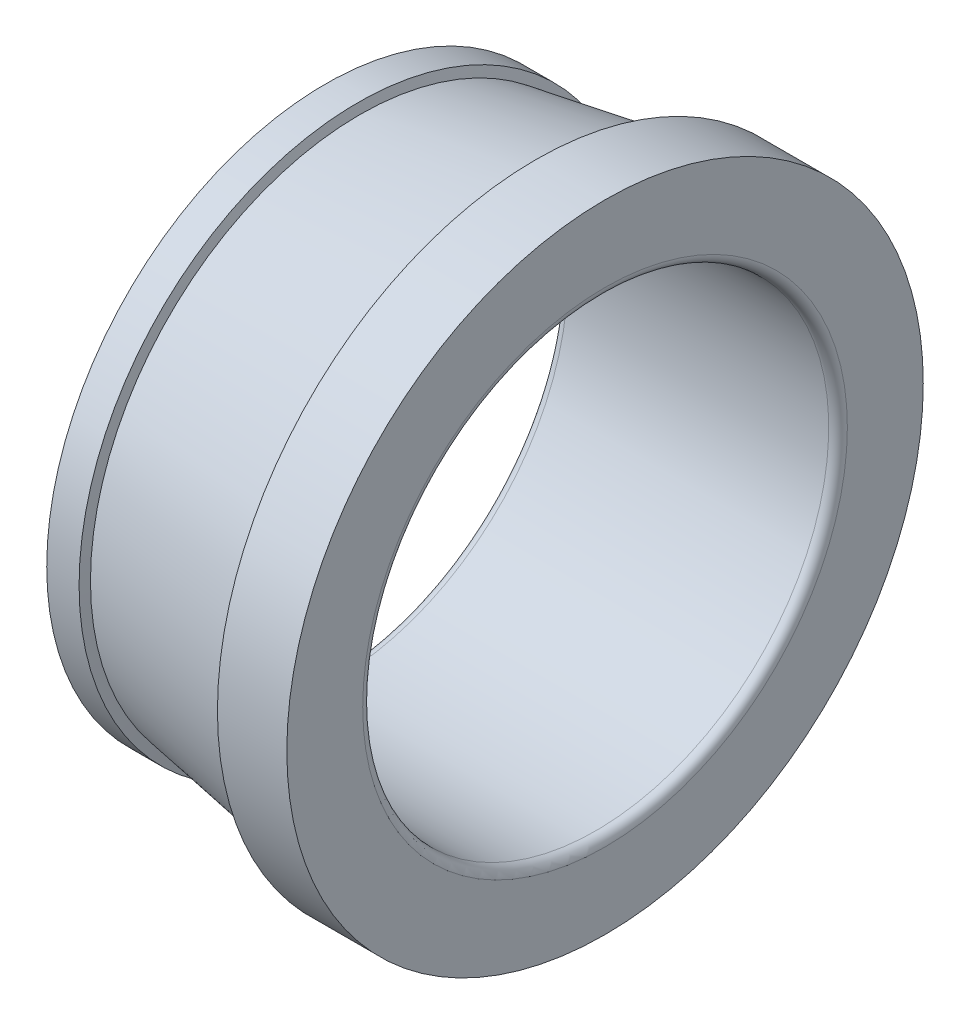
ISO-10303-21;
HEADER;
FILE_DESCRIPTION(('STEP AP214'),'2;1');
FILE_NAME('part.step','',(''),(''),'','','');
FILE_SCHEMA(('AUTOMOTIVE_DESIGN { 1 0 10303 214 1 1 1 1 }'));
ENDSEC;
DATA;
#1=APPLICATION_CONTEXT('core data for automotive mechanical design processes');
#2=APPLICATION_PROTOCOL_DEFINITION('international standard','automotive_design',2000,#1);
#3=PRODUCT_CONTEXT('',#1,'mechanical');
#4=PRODUCT('Part','Part','',(#3));
#5=PRODUCT_RELATED_PRODUCT_CATEGORY('part','',(#4));
#6=PRODUCT_DEFINITION_FORMATION('','',#4);
#7=PRODUCT_DEFINITION_CONTEXT('part definition',#1,'design');
#8=PRODUCT_DEFINITION('design','',#6,#7);
#9=PRODUCT_DEFINITION_SHAPE('','',#8);
#10=(LENGTH_UNIT() NAMED_UNIT(*) SI_UNIT(.MILLI.,.METRE.));
#11=(NAMED_UNIT(*) PLANE_ANGLE_UNIT() SI_UNIT($,.RADIAN.));
#12=(NAMED_UNIT(*) SI_UNIT($,.STERADIAN.) SOLID_ANGLE_UNIT());
#13=UNCERTAINTY_MEASURE_WITH_UNIT(LENGTH_MEASURE(1.E-05),#10,'distance_accuracy_value','');
#14=(GEOMETRIC_REPRESENTATION_CONTEXT(3) GLOBAL_UNCERTAINTY_ASSIGNED_CONTEXT((#13)) GLOBAL_UNIT_ASSIGNED_CONTEXT((#10,
#11,#12)) REPRESENTATION_CONTEXT('',''));
#15=CARTESIAN_POINT('',(0.,0.,0.));
#16=DIRECTION('',(0.,0.,1.));
#17=DIRECTION('',(1.,0.,0.));
#18=AXIS2_PLACEMENT_3D('',#15,#16,#17);
#19=CARTESIAN_POINT('',(0.500000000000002,0.,0.));
#20=DIRECTION('',(-1.,0.,0.));
#21=DIRECTION('',(0.,0.,1.));
#22=AXIS2_PLACEMENT_3D('',#19,#20,#21);
#23=TOROIDAL_SURFACE('',#22,13.,0.499999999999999);
#24=CARTESIAN_POINT('',(0.500000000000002,0.,0.));
#25=DIRECTION('',(-1.,0.,0.));
#26=DIRECTION('',(0.,0.,1.));
#27=AXIS2_PLACEMENT_3D('',#24,#25,#26);
#28=CIRCLE('',#27,12.5);
#29=CARTESIAN_POINT('',(0.500000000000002,0.,12.5));
#30=VERTEX_POINT('',#29);
#31=EDGE_CURVE('E10',#30,#30,#28,.T.);
#32=ORIENTED_EDGE('',*,*,#31,.F.);
#33=EDGE_LOOP('',(#32));
#34=FACE_BOUND('',#33,.T.);
#35=CARTESIAN_POINT('',(0.,0.,0.));
#36=DIRECTION('',(-1.,0.,0.));
#37=DIRECTION('',(0.,0.,1.));
#38=AXIS2_PLACEMENT_3D('',#35,#36,#37);
#39=CIRCLE('',#38,13.);
#40=CARTESIAN_POINT('',(0.,0.,13.));
#41=VERTEX_POINT('',#40);
#42=EDGE_CURVE('E58',#41,#41,#39,.T.);
#43=ORIENTED_EDGE('',*,*,#42,.T.);
#44=EDGE_LOOP('',(#43));
#45=FACE_BOUND('',#44,.T.);
#46=ADVANCED_FACE('F24',(#34,#45),#23,.T.);
#47=CARTESIAN_POINT('',(0.,0.,0.));
#48=DIRECTION('',(-1.,0.,0.));
#49=DIRECTION('',(0.,0.,1.));
#50=AXIS2_PLACEMENT_3D('',#47,#48,#49);
#51=CYLINDRICAL_SURFACE('',#50,12.5);
#52=CARTESIAN_POINT('',(14.5,0.,0.));
#53=DIRECTION('',(-1.,0.,0.));
#54=DIRECTION('',(0.,0.,1.));
#55=AXIS2_PLACEMENT_3D('',#52,#53,#54);
#56=CIRCLE('',#55,12.5);
#57=CARTESIAN_POINT('',(14.5,0.,12.5));
#58=VERTEX_POINT('',#57);
#59=EDGE_CURVE('E30',#58,#58,#56,.T.);
#60=ORIENTED_EDGE('',*,*,#59,.F.);
#61=EDGE_LOOP('',(#60));
#62=FACE_BOUND('',#61,.T.);
#63=ORIENTED_EDGE('',*,*,#31,.T.);
#64=EDGE_LOOP('',(#63));
#65=FACE_BOUND('',#64,.T.);
#66=ADVANCED_FACE('F107',(#62,#65),#51,.F.);
#67=CARTESIAN_POINT('',(14.5,0.,0.));
#68=DIRECTION('',(-1.,0.,0.));
#69=DIRECTION('',(0.,0.,1.));
#70=AXIS2_PLACEMENT_3D('',#67,#68,#69);
#71=TOROIDAL_SURFACE('',#70,13.,0.5);
#72=CARTESIAN_POINT('',(15.,0.,0.));
#73=DIRECTION('',(-1.,0.,0.));
#74=DIRECTION('',(0.,0.,1.));
#75=AXIS2_PLACEMENT_3D('',#72,#73,#74);
#76=CIRCLE('',#75,13.);
#77=CARTESIAN_POINT('',(15.,0.,13.));
#78=VERTEX_POINT('',#77);
#79=EDGE_CURVE('E34',#78,#78,#76,.T.);
#80=ORIENTED_EDGE('',*,*,#79,.F.);
#81=EDGE_LOOP('',(#80));
#82=FACE_BOUND('',#81,.T.);
#83=ORIENTED_EDGE('',*,*,#59,.T.);
#84=EDGE_LOOP('',(#83));
#85=FACE_BOUND('',#84,.T.);
#86=ADVANCED_FACE('F102',(#82,#85),#71,.T.);
#87=CARTESIAN_POINT('',(15.,0.,-17.0718058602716));
#88=DIRECTION('',(-1.,0.,0.));
#89=DIRECTION('',(0.,0.,1.));
#90=AXIS2_PLACEMENT_3D('',#87,#88,#89);
#91=PLANE('',#90);
#92=CARTESIAN_POINT('',(15.,0.,0.));
#93=DIRECTION('',(-1.,0.,0.));
#94=DIRECTION('',(0.,0.,1.));
#95=AXIS2_PLACEMENT_3D('',#92,#93,#94);
#96=CIRCLE('',#95,17.0718058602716);
#97=CARTESIAN_POINT('',(15.,0.,17.0718058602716));
#98=VERTEX_POINT('',#97);
#99=EDGE_CURVE('E38',#98,#98,#96,.T.);
#100=ORIENTED_EDGE('',*,*,#99,.F.);
#101=EDGE_LOOP('',(#100));
#102=FACE_BOUND('',#101,.T.);
#103=ORIENTED_EDGE('',*,*,#79,.T.);
#104=EDGE_LOOP('',(#103));
#105=FACE_BOUND('',#104,.T.);
#106=ADVANCED_FACE('F96',(#102,#105),#91,.F.);
#107=CARTESIAN_POINT('',(0.,0.,0.));
#108=DIRECTION('',(-1.,0.,0.));
#109=DIRECTION('',(0.,0.,1.));
#110=AXIS2_PLACEMENT_3D('',#107,#108,#109);
#111=CYLINDRICAL_SURFACE('',#110,17.0718058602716);
#112=CARTESIAN_POINT('',(11.2777777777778,0.,0.));
#113=DIRECTION('',(-1.,0.,0.));
#114=DIRECTION('',(0.,0.,1.));
#115=AXIS2_PLACEMENT_3D('',#112,#113,#114);
#116=CIRCLE('',#115,17.0718058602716);
#117=CARTESIAN_POINT('',(11.2777777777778,0.,17.0718058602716));
#118=VERTEX_POINT('',#117);
#119=EDGE_CURVE('E43',#118,#118,#116,.T.);
#120=ORIENTED_EDGE('',*,*,#119,.F.);
#121=EDGE_LOOP('',(#120));
#122=FACE_BOUND('',#121,.T.);
#123=ORIENTED_EDGE('',*,*,#99,.T.);
#124=EDGE_LOOP('',(#123));
#125=FACE_BOUND('',#124,.T.);
#126=ADVANCED_FACE('F90',(#122,#125),#111,.T.);
#127=CARTESIAN_POINT('',(11.2777777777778,0.,0.));
#128=DIRECTION('',(-1.,0.,0.));
#129=DIRECTION('',(0.,0.,1.));
#130=AXIS2_PLACEMENT_3D('',#127,#128,#129);
#131=CONICAL_SURFACE('',#130,17.0718058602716,1.35212738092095);
#132=CARTESIAN_POINT('',(11.5,0.,0.));
#133=DIRECTION('',(-1.,0.,0.));
#134=DIRECTION('',(0.,0.,1.));
#135=AXIS2_PLACEMENT_3D('',#132,#133,#134);
#136=CIRCLE('',#135,16.0718058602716);
#137=CARTESIAN_POINT('',(11.5,0.,16.0718058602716));
#138=VERTEX_POINT('',#137);
#139=EDGE_CURVE('E46',#138,#138,#136,.T.);
#140=ORIENTED_EDGE('',*,*,#139,.F.);
#141=EDGE_LOOP('',(#140));
#142=FACE_BOUND('',#141,.T.);
#143=ORIENTED_EDGE('',*,*,#119,.T.);
#144=EDGE_LOOP('',(#143));
#145=FACE_BOUND('',#144,.T.);
#146=ADVANCED_FACE('F84',(#142,#145),#131,.F.);
#147=CARTESIAN_POINT('',(11.5,0.,0.));
#148=DIRECTION('',(1.,0.,0.));
#149=DIRECTION('',(0.,0.,-1.));
#150=AXIS2_PLACEMENT_3D('',#147,#148,#149);
#151=CONICAL_SURFACE('',#150,16.0718058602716,0.16630906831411);
#152=CARTESIAN_POINT('',(1.84556731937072,0.,0.));
#153=DIRECTION('',(-1.,0.,0.));
#154=DIRECTION('',(0.,0.,1.));
#155=AXIS2_PLACEMENT_3D('',#152,#153,#154);
#156=CIRCLE('',#155,14.4512174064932);
#157=CARTESIAN_POINT('',(1.84556731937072,0.,14.4512174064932));
#158=VERTEX_POINT('',#157);
#159=EDGE_CURVE('E49',#158,#158,#156,.T.);
#160=ORIENTED_EDGE('',*,*,#159,.F.);
#161=EDGE_LOOP('',(#160));
#162=FACE_BOUND('',#161,.T.);
#163=ORIENTED_EDGE('',*,*,#139,.T.);
#164=EDGE_LOOP('',(#163));
#165=FACE_BOUND('',#164,.T.);
#166=ADVANCED_FACE('F78',(#162,#165),#151,.T.);
#167=CARTESIAN_POINT('',(1.84556731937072,0.,0.));
#168=DIRECTION('',(-1.,0.,0.));
#169=DIRECTION('',(0.,0.,1.));
#170=AXIS2_PLACEMENT_3D('',#167,#168,#169);
#171=CONICAL_SURFACE('',#170,14.4512174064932,1.35212738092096);
#172=CARTESIAN_POINT('',(1.73445620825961,0.,0.));
#173=DIRECTION('',(-1.,0.,0.));
#174=DIRECTION('',(0.,0.,1.));
#175=AXIS2_PLACEMENT_3D('',#172,#173,#174);
#176=CIRCLE('',#175,14.9512174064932);
#177=CARTESIAN_POINT('',(1.73445620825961,0.,14.9512174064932));
#178=VERTEX_POINT('',#177);
#179=EDGE_CURVE('E52',#178,#178,#176,.T.);
#180=ORIENTED_EDGE('',*,*,#179,.F.);
#181=EDGE_LOOP('',(#180));
#182=FACE_BOUND('',#181,.T.);
#183=ORIENTED_EDGE('',*,*,#159,.T.);
#184=EDGE_LOOP('',(#183));
#185=FACE_BOUND('',#184,.T.);
#186=ADVANCED_FACE('F72',(#182,#185),#171,.T.);
#187=CARTESIAN_POINT('',(0.,0.,0.));
#188=DIRECTION('',(-1.,0.,0.));
#189=DIRECTION('',(0.,0.,1.));
#190=AXIS2_PLACEMENT_3D('',#187,#188,#189);
#191=CYLINDRICAL_SURFACE('',#190,14.9512174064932);
#192=CARTESIAN_POINT('',(0.,0.,0.));
#193=DIRECTION('',(-1.,0.,0.));
#194=DIRECTION('',(0.,0.,1.));
#195=AXIS2_PLACEMENT_3D('',#192,#193,#194);
#196=CIRCLE('',#195,14.9512174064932);
#197=CARTESIAN_POINT('',(0.,0.,14.9512174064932));
#198=VERTEX_POINT('',#197);
#199=EDGE_CURVE('E55',#198,#198,#196,.T.);
#200=ORIENTED_EDGE('',*,*,#199,.F.);
#201=EDGE_LOOP('',(#200));
#202=FACE_BOUND('',#201,.T.);
#203=ORIENTED_EDGE('',*,*,#179,.T.);
#204=EDGE_LOOP('',(#203));
#205=FACE_BOUND('',#204,.T.);
#206=ADVANCED_FACE('F66',(#202,#205),#191,.T.);
#207=CARTESIAN_POINT('',(0.,0.,-13.));
#208=DIRECTION('',(1.,0.,0.));
#209=DIRECTION('',(0.,0.,-1.));
#210=AXIS2_PLACEMENT_3D('',#207,#208,#209);
#211=PLANE('',#210);
#212=ORIENTED_EDGE('',*,*,#42,.F.);
#213=EDGE_LOOP('',(#212));
#214=FACE_BOUND('',#213,.T.);
#215=ORIENTED_EDGE('',*,*,#199,.T.);
#216=EDGE_LOOP('',(#215));
#217=FACE_BOUND('',#216,.T.);
#218=ADVANCED_FACE('F63',(#214,#217),#211,.F.);
#219=CLOSED_SHELL('',(#46,#66,#86,#106,#126,#146,#166,#186,#206,#218));
#220=MANIFOLD_SOLID_BREP('B2',#219);
#221=ADVANCED_BREP_SHAPE_REPRESENTATION('',(#18,#220),#14);
#222=SHAPE_DEFINITION_REPRESENTATION(#9,#221);
ENDSEC;
END-ISO-10303-21;
